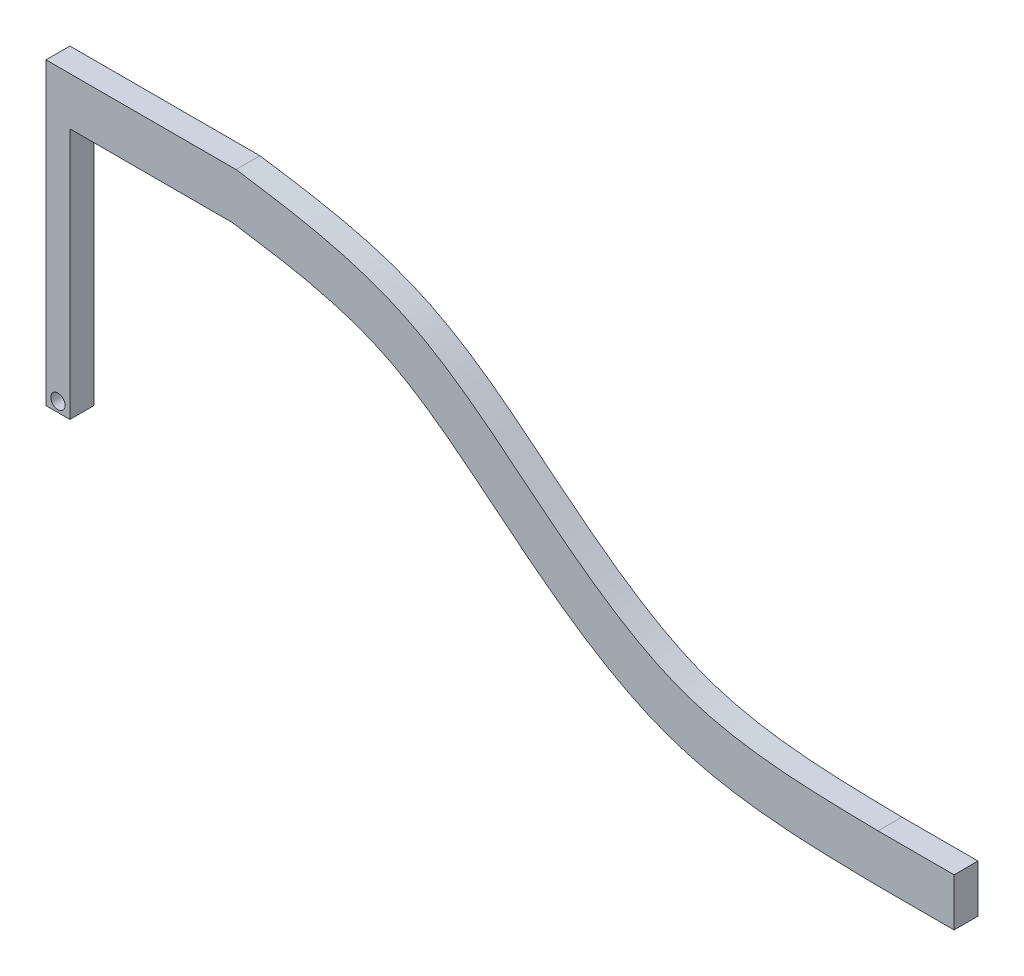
ISO-10303-21;
HEADER;
FILE_DESCRIPTION(('STEP AP214'),'2;1');
FILE_NAME('part.step','',(''),(''),'','','');
FILE_SCHEMA(('AUTOMOTIVE_DESIGN { 1 0 10303 214 1 1 1 1 }'));
ENDSEC;
DATA;
#1=APPLICATION_CONTEXT('core data for automotive mechanical design processes');
#2=APPLICATION_PROTOCOL_DEFINITION('international standard','automotive_design',2000,#1);
#3=PRODUCT_CONTEXT('',#1,'mechanical');
#4=PRODUCT('Part','Part','',(#3));
#5=PRODUCT_RELATED_PRODUCT_CATEGORY('part','',(#4));
#6=PRODUCT_DEFINITION_FORMATION('','',#4);
#7=PRODUCT_DEFINITION_CONTEXT('part definition',#1,'design');
#8=PRODUCT_DEFINITION('design','',#6,#7);
#9=PRODUCT_DEFINITION_SHAPE('','',#8);
#10=(LENGTH_UNIT() NAMED_UNIT(*) SI_UNIT(.MILLI.,.METRE.));
#11=(NAMED_UNIT(*) PLANE_ANGLE_UNIT() SI_UNIT($,.RADIAN.));
#12=(NAMED_UNIT(*) SI_UNIT($,.STERADIAN.) SOLID_ANGLE_UNIT());
#13=UNCERTAINTY_MEASURE_WITH_UNIT(LENGTH_MEASURE(1.E-05),#10,'distance_accuracy_value','');
#14=(GEOMETRIC_REPRESENTATION_CONTEXT(3) GLOBAL_UNCERTAINTY_ASSIGNED_CONTEXT((#13)) GLOBAL_UNIT_ASSIGNED_CONTEXT((#10,
#11,#12)) REPRESENTATION_CONTEXT('',''));
#15=CARTESIAN_POINT('',(0.,0.,0.));
#16=DIRECTION('',(0.,0.,1.));
#17=DIRECTION('',(1.,0.,0.));
#18=AXIS2_PLACEMENT_3D('',#15,#16,#17);
#19=CARTESIAN_POINT('',(0.,15.922114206,1.27));
#20=DIRECTION('',(0.,1.,0.));
#21=DIRECTION('',(0.,0.,1.));
#22=AXIS2_PLACEMENT_3D('',#19,#20,#21);
#23=PLANE('',#22);
#24=DIRECTION('',(1.,0.,0.));
#25=VECTOR('',#24,1.);
#26=CARTESIAN_POINT('',(0.,15.922114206,0.));
#27=LINE('',#26,#25);
#28=CARTESIAN_POINT('',(-1.27,15.922114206,0.));
#29=VERTEX_POINT('',#28);
#30=CARTESIAN_POINT('',(8.83455771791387,15.922114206,0.));
#31=VERTEX_POINT('',#30);
#32=EDGE_CURVE('E198',#29,#31,#27,.T.);
#33=ORIENTED_EDGE('',*,*,#32,.F.);
#34=DIRECTION('',(0.,0.,-1.));
#35=VECTOR('',#34,1.);
#36=CARTESIAN_POINT('',(-1.27,15.922114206,67.9279261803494));
#37=LINE('',#36,#35);
#38=CARTESIAN_POINT('',(-1.27,15.922114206,1.26999999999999));
#39=VERTEX_POINT('',#38);
#40=EDGE_CURVE('E46',#39,#29,#37,.T.);
#41=ORIENTED_EDGE('',*,*,#40,.F.);
#42=DIRECTION('',(1.,0.,0.));
#43=VECTOR('',#42,1.);
#44=CARTESIAN_POINT('',(0.,15.922114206,1.27));
#45=LINE('',#44,#43);
#46=CARTESIAN_POINT('',(8.83455771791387,15.922114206,1.27));
#47=VERTEX_POINT('',#46);
#48=EDGE_CURVE('E178',#39,#47,#45,.T.);
#49=ORIENTED_EDGE('',*,*,#48,.T.);
#50=DIRECTION('',(0.,0.,-1.));
#51=VECTOR('',#50,1.);
#52=CARTESIAN_POINT('',(8.83455771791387,15.922114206,1.27));
#53=LINE('',#52,#51);
#54=EDGE_CURVE('E206',#47,#31,#53,.T.);
#55=ORIENTED_EDGE('',*,*,#54,.T.);
#56=EDGE_LOOP('',(#33,#41,#49,#55));
#57=FACE_BOUND('',#56,.T.);
#58=ADVANCED_FACE('F31',(#57),#23,.T.);
#59=CARTESIAN_POINT('',(0.,0.,1.27));
#60=DIRECTION('',(0.,-1.,0.));
#61=DIRECTION('',(0.,0.,-1.));
#62=AXIS2_PLACEMENT_3D('',#59,#60,#61);
#63=PLANE('',#62);
#64=DIRECTION('',(-1.,0.,0.));
#65=VECTOR('',#64,1.);
#66=CARTESIAN_POINT('',(0.,0.,1.27));
#67=LINE('',#66,#65);
#68=CARTESIAN_POINT('',(0.,0.,1.27));
#69=VERTEX_POINT('',#68);
#70=CARTESIAN_POINT('',(-1.27,0.,1.26999999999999));
#71=VERTEX_POINT('',#70);
#72=EDGE_CURVE('E119',#69,#71,#67,.T.);
#73=ORIENTED_EDGE('',*,*,#72,.T.);
#74=DIRECTION('',(0.,0.,-1.));
#75=VECTOR('',#74,1.);
#76=CARTESIAN_POINT('',(-1.27,0.,67.9279261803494));
#77=LINE('',#76,#75);
#78=CARTESIAN_POINT('',(-1.27,0.,0.));
#79=VERTEX_POINT('',#78);
#80=EDGE_CURVE('E189',#71,#79,#77,.T.);
#81=ORIENTED_EDGE('',*,*,#80,.T.);
#82=DIRECTION('',(-1.,0.,0.));
#83=VECTOR('',#82,1.);
#84=CARTESIAN_POINT('',(0.,0.,0.));
#85=LINE('',#84,#83);
#86=CARTESIAN_POINT('',(0.,0.,0.));
#87=VERTEX_POINT('',#86);
#88=EDGE_CURVE('E236',#87,#79,#85,.T.);
#89=ORIENTED_EDGE('',*,*,#88,.F.);
#90=DIRECTION('',(0.,0.,-1.));
#91=VECTOR('',#90,1.);
#92=CARTESIAN_POINT('',(0.,0.,1.27));
#93=LINE('',#92,#91);
#94=EDGE_CURVE('E129',#69,#87,#93,.T.);
#95=ORIENTED_EDGE('',*,*,#94,.F.);
#96=EDGE_LOOP('',(#73,#81,#89,#95));
#97=FACE_BOUND('',#96,.T.);
#98=ADVANCED_FACE('F159',(#97),#63,.T.);
#99=CARTESIAN_POINT('',(26.7020393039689,7.21110102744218,1.27));
#100=DIRECTION('',(0.,0.,-1.));
#101=DIRECTION('',(-1.,0.,0.));
#102=AXIS2_PLACEMENT_3D('',#99,#100,#101);
#103=PLANE('',#102);
#104=CARTESIAN_POINT('',(-0.635,0.517047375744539,1.27));
#105=DIRECTION('',(0.,0.,1.));
#106=DIRECTION('',(1.,0.,0.));
#107=AXIS2_PLACEMENT_3D('',#104,#105,#106);
#108=CIRCLE('',#107,0.381);
#109=CARTESIAN_POINT('',(-0.254,0.517047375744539,1.27));
#110=VERTEX_POINT('',#109);
#111=EDGE_CURVE('E252',#110,#110,#108,.T.);
#112=ORIENTED_EDGE('',*,*,#111,.F.);
#113=EDGE_LOOP('',(#112));
#114=FACE_BOUND('',#113,.T.);
#115=DIRECTION('',(0.,1.,0.));
#116=VECTOR('',#115,1.);
#117=CARTESIAN_POINT('',(-1.27,7.21110102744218,1.27));
#118=LINE('',#117,#116);
#119=EDGE_CURVE('E192',#71,#39,#118,.T.);
#120=ORIENTED_EDGE('',*,*,#119,.F.);
#121=ORIENTED_EDGE('',*,*,#72,.F.);
#122=DIRECTION('',(0.,1.,0.));
#123=VECTOR('',#122,1.);
#124=CARTESIAN_POINT('',(0.,0.,1.27));
#125=LINE('',#124,#123);
#126=CARTESIAN_POINT('',(0.,13.382114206,1.27));
#127=VERTEX_POINT('',#126);
#128=EDGE_CURVE('E111',#69,#127,#125,.T.);
#129=ORIENTED_EDGE('',*,*,#128,.T.);
#130=DIRECTION('',(1.,0.,0.));
#131=VECTOR('',#130,1.);
#132=CARTESIAN_POINT('',(0.,13.382114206,1.27));
#133=LINE('',#132,#131);
#134=CARTESIAN_POINT('',(8.64245458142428,13.382114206,1.27));
#135=VERTEX_POINT('',#134);
#136=EDGE_CURVE('E116',#127,#135,#133,.T.);
#137=ORIENTED_EDGE('',*,*,#136,.T.);
#138=CARTESIAN_POINT('',(8.64245458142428,13.382114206,1.27));
#139=CARTESIAN_POINT('',(11.3837031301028,12.9650811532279,1.27));
#140=CARTESIAN_POINT('',(16.6168440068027,12.1689502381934,1.27));
#141=CARTESIAN_POINT('',(23.466093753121,6.44904374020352,1.27));
#142=CARTESIAN_POINT('',(31.478990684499,0.189830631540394,1.27));
#143=CARTESIAN_POINT('',(39.0643321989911,0.0642075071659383,1.27));
#144=CARTESIAN_POINT('',(42.9412925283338,0.,1.27));
#145=B_SPLINE_CURVE_WITH_KNOTS('',3,(#138,#139,#140,#141,#142,#143,#144),.UNSPECIFIED.,.F.,.F.,
(4,1,1,1,4),(0.,0.216097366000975,0.412537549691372,0.699740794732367,1.),.UNSPECIFIED.);
#146=CARTESIAN_POINT('',(42.9412925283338,0.,1.27));
#147=VERTEX_POINT('',#146);
#148=EDGE_CURVE('E54',#135,#147,#145,.T.);
#149=ORIENTED_EDGE('',*,*,#148,.T.);
#150=DIRECTION('',(1.,0.,0.));
#151=VECTOR('',#150,1.);
#152=CARTESIAN_POINT('',(42.9412925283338,0.,1.27));
#153=LINE('',#152,#151);
#154=CARTESIAN_POINT('',(47.0052925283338,0.,1.27));
#155=VERTEX_POINT('',#154);
#156=EDGE_CURVE('E93',#147,#155,#153,.T.);
#157=ORIENTED_EDGE('',*,*,#156,.T.);
#158=DIRECTION('',(0.,-1.,0.));
#159=VECTOR('',#158,1.);
#160=CARTESIAN_POINT('',(47.0052925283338,2.54,1.27));
#161=LINE('',#160,#159);
#162=CARTESIAN_POINT('',(47.0052925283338,2.54,1.27));
#163=VERTEX_POINT('',#162);
#164=EDGE_CURVE('E222',#163,#155,#161,.T.);
#165=ORIENTED_EDGE('',*,*,#164,.F.);
#166=DIRECTION('',(1.,0.,0.));
#167=VECTOR('',#166,1.);
#168=CARTESIAN_POINT('',(42.9412925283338,2.54,1.27));
#169=LINE('',#168,#167);
#170=CARTESIAN_POINT('',(42.9623243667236,2.54,1.27));
#171=VERTEX_POINT('',#170);
#172=EDGE_CURVE('E179',#171,#163,#169,.T.);
#173=ORIENTED_EDGE('',*,*,#172,.F.);
#174=CARTESIAN_POINT('',(8.83455771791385,15.922114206,1.27));
#175=CARTESIAN_POINT('',(9.23273478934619,15.8615385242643,1.27));
#176=CARTESIAN_POINT('',(9.63311586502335,15.8009005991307,1.27));
#177=CARTESIAN_POINT('',(10.4441054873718,15.6741757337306,1.27));
#178=CARTESIAN_POINT('',(10.8535402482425,15.6082191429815,1.27));
#179=CARTESIAN_POINT('',(12.0908968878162,15.3953394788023,1.27));
#180=CARTESIAN_POINT('',(12.9279317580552,15.2336201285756,1.27));
#181=CARTESIAN_POINT('',(14.6114985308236,14.8272292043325,1.27));
#182=CARTESIAN_POINT('',(15.4583285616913,14.5824900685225,1.27));
#183=CARTESIAN_POINT('',(16.7207698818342,14.115925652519,1.27));
#184=CARTESIAN_POINT('',(17.1402076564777,13.9437798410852,1.27));
#185=CARTESIAN_POINT('',(17.9724186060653,13.5599427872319,1.27));
#186=CARTESIAN_POINT('',(18.3764903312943,13.3519568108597,1.27));
#187=CARTESIAN_POINT('',(19.5491715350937,12.6952136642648,1.27));
#188=CARTESIAN_POINT('',(20.2815702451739,12.2126050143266,1.27));
#189=CARTESIAN_POINT('',(21.677061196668,11.2109690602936,1.27));
#190=CARTESIAN_POINT('',(22.3404330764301,10.6917151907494,1.27));
#191=CARTESIAN_POINT('',(23.6255901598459,9.65963581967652,1.27));
#192=CARTESIAN_POINT('',(24.2449733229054,9.14974524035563,1.27));
#193=CARTESIAN_POINT('',(25.4784794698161,8.1566812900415,1.27));
#194=CARTESIAN_POINT('',(26.0912160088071,7.67245835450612,1.27));
#195=CARTESIAN_POINT('',(27.9236858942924,6.28838637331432,1.27));
#196=CARTESIAN_POINT('',(29.1380165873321,5.45869430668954,1.27));
#197=CARTESIAN_POINT('',(30.9601431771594,4.46366236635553,1.27));
#198=CARTESIAN_POINT('',(31.5674093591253,4.17321837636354,1.27));
#199=CARTESIAN_POINT('',(32.481150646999,3.8087078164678,1.27));
#200=CARTESIAN_POINT('',(32.7851437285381,3.69964034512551,1.27));
#201=CARTESIAN_POINT('',(33.4102256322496,3.49948761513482,1.27));
#202=CARTESIAN_POINT('',(33.7295545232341,3.40886505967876,1.27));
#203=CARTESIAN_POINT('',(35.3598925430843,2.99892132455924,1.27));
#204=CARTESIAN_POINT('',(36.7742000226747,2.81059923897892,1.27));
#205=CARTESIAN_POINT('',(39.7660493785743,2.59467989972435,1.27));
#206=CARTESIAN_POINT('',(41.3415368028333,2.56684399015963,1.27));
#207=CARTESIAN_POINT('',(42.9623243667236,2.54,1.27));
#208=B_SPLINE_CURVE_WITH_KNOTS('',3,(#174,#175,#176,#177,#178,#179,#180,#181,#182,#183,#184,
#185,#186,#187,#188,#189,#190,#191,#192,#193,#194,#195,#196,#197,#198,#199,#200,#201,#202,#203,
#204,#205,#206,#207),.UNSPECIFIED.,.F.,.F.,(4,2,2,2,2,2,2,2,2,2,2,2,2,2,2,2,4),(0.,
0.0312499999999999,0.0624999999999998,0.125,0.1875,0.21875,0.25,0.3125,0.375,0.4375,0.5,0.625,
0.6875,0.71875,0.750000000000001,0.875,1.),.UNSPECIFIED.);
#209=EDGE_CURVE('E171',#47,#171,#208,.T.);
#210=ORIENTED_EDGE('',*,*,#209,.F.);
#211=ORIENTED_EDGE('',*,*,#48,.F.);
#212=EDGE_LOOP('',(#120,#121,#129,#137,#149,#157,#165,#173,#210,#211));
#213=FACE_BOUND('',#212,.T.);
#214=ADVANCED_FACE('F114',(#114,#213),#103,.F.);
#215=CARTESIAN_POINT('',(26.7020393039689,7.21110102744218,0.));
#216=DIRECTION('',(0.,0.,-1.));
#217=DIRECTION('',(-1.,0.,0.));
#218=AXIS2_PLACEMENT_3D('',#215,#216,#217);
#219=PLANE('',#218);
#220=CARTESIAN_POINT('',(-0.635,0.517047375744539,0.));
#221=DIRECTION('',(0.,0.,1.));
#222=DIRECTION('',(1.,0.,0.));
#223=AXIS2_PLACEMENT_3D('',#220,#221,#222);
#224=CIRCLE('',#223,0.381);
#225=CARTESIAN_POINT('',(-0.254,0.517047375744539,0.));
#226=VERTEX_POINT('',#225);
#227=EDGE_CURVE('E250',#226,#226,#224,.T.);
#228=ORIENTED_EDGE('',*,*,#227,.T.);
#229=EDGE_LOOP('',(#228));
#230=FACE_BOUND('',#229,.T.);
#231=ORIENTED_EDGE('',*,*,#88,.T.);
#232=DIRECTION('',(0.,1.,0.));
#233=VECTOR('',#232,1.);
#234=CARTESIAN_POINT('',(-1.27,7.21110102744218,0.));
#235=LINE('',#234,#233);
#236=EDGE_CURVE('E11',#79,#29,#235,.T.);
#237=ORIENTED_EDGE('',*,*,#236,.T.);
#238=ORIENTED_EDGE('',*,*,#32,.T.);
#239=CARTESIAN_POINT('',(8.83455771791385,15.922114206,0.));
#240=CARTESIAN_POINT('',(9.23273478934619,15.8615385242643,0.));
#241=CARTESIAN_POINT('',(9.63311586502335,15.8009005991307,0.));
#242=CARTESIAN_POINT('',(10.4441054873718,15.6741757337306,0.));
#243=CARTESIAN_POINT('',(10.8535402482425,15.6082191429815,0.));
#244=CARTESIAN_POINT('',(12.0908968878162,15.3953394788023,0.));
#245=CARTESIAN_POINT('',(12.9279317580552,15.2336201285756,0.));
#246=CARTESIAN_POINT('',(14.6114985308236,14.8272292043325,0.));
#247=CARTESIAN_POINT('',(15.4583285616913,14.5824900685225,0.));
#248=CARTESIAN_POINT('',(16.7207698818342,14.115925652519,0.));
#249=CARTESIAN_POINT('',(17.1402076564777,13.9437798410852,0.));
#250=CARTESIAN_POINT('',(17.9724186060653,13.5599427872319,0.));
#251=CARTESIAN_POINT('',(18.3764903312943,13.3519568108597,0.));
#252=CARTESIAN_POINT('',(19.5491715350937,12.6952136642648,0.));
#253=CARTESIAN_POINT('',(20.2815702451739,12.2126050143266,0.));
#254=CARTESIAN_POINT('',(21.677061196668,11.2109690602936,0.));
#255=CARTESIAN_POINT('',(22.3404330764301,10.6917151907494,0.));
#256=CARTESIAN_POINT('',(23.6255901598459,9.65963581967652,0.));
#257=CARTESIAN_POINT('',(24.2449733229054,9.14974524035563,0.));
#258=CARTESIAN_POINT('',(25.4784794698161,8.1566812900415,0.));
#259=CARTESIAN_POINT('',(26.0912160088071,7.67245835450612,0.));
#260=CARTESIAN_POINT('',(27.9236858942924,6.28838637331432,0.));
#261=CARTESIAN_POINT('',(29.1380165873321,5.45869430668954,0.));
#262=CARTESIAN_POINT('',(30.9601431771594,4.46366236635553,0.));
#263=CARTESIAN_POINT('',(31.5674093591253,4.17321837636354,0.));
#264=CARTESIAN_POINT('',(32.481150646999,3.8087078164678,0.));
#265=CARTESIAN_POINT('',(32.7851437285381,3.69964034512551,0.));
#266=CARTESIAN_POINT('',(33.4102256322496,3.49948761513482,0.));
#267=CARTESIAN_POINT('',(33.7295545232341,3.40886505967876,0.));
#268=CARTESIAN_POINT('',(35.3598925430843,2.99892132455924,0.));
#269=CARTESIAN_POINT('',(36.7742000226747,2.81059923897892,0.));
#270=CARTESIAN_POINT('',(39.7660493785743,2.59467989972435,0.));
#271=CARTESIAN_POINT('',(41.3415368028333,2.56684399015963,0.));
#272=CARTESIAN_POINT('',(42.9623243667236,2.54,0.));
#273=B_SPLINE_CURVE_WITH_KNOTS('',3,(#239,#240,#241,#242,#243,#244,#245,#246,#247,#248,#249,
#250,#251,#252,#253,#254,#255,#256,#257,#258,#259,#260,#261,#262,#263,#264,#265,#266,#267,#268,
#269,#270,#271,#272),.UNSPECIFIED.,.F.,.F.,(4,2,2,2,2,2,2,2,2,2,2,2,2,2,2,2,4),(0.,
0.0312499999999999,0.0624999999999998,0.125,0.1875,0.21875,0.25,0.3125,0.375,0.4375,0.5,0.625,
0.6875,0.71875,0.750000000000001,0.875,1.),.UNSPECIFIED.);
#274=CARTESIAN_POINT('',(42.9623243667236,2.54,0.));
#275=VERTEX_POINT('',#274);
#276=EDGE_CURVE('E208',#31,#275,#273,.T.);
#277=ORIENTED_EDGE('',*,*,#276,.T.);
#278=DIRECTION('',(1.,0.,0.));
#279=VECTOR('',#278,1.);
#280=CARTESIAN_POINT('',(42.9412925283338,2.54,0.));
#281=LINE('',#280,#279);
#282=CARTESIAN_POINT('',(47.0052925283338,2.54,0.));
#283=VERTEX_POINT('',#282);
#284=EDGE_CURVE('E226',#275,#283,#281,.T.);
#285=ORIENTED_EDGE('',*,*,#284,.T.);
#286=DIRECTION('',(0.,-1.,0.));
#287=VECTOR('',#286,1.);
#288=CARTESIAN_POINT('',(47.0052925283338,2.54,0.));
#289=LINE('',#288,#287);
#290=CARTESIAN_POINT('',(47.0052925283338,0.,0.));
#291=VERTEX_POINT('',#290);
#292=EDGE_CURVE('E220',#283,#291,#289,.T.);
#293=ORIENTED_EDGE('',*,*,#292,.T.);
#294=DIRECTION('',(1.,0.,0.));
#295=VECTOR('',#294,1.);
#296=CARTESIAN_POINT('',(42.9412925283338,0.,0.));
#297=LINE('',#296,#295);
#298=CARTESIAN_POINT('',(42.9412925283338,0.,0.));
#299=VERTEX_POINT('',#298);
#300=EDGE_CURVE('E141',#299,#291,#297,.T.);
#301=ORIENTED_EDGE('',*,*,#300,.F.);
#302=CARTESIAN_POINT('',(8.64245458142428,13.382114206,0.));
#303=CARTESIAN_POINT('',(11.3837031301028,12.9650811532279,0.));
#304=CARTESIAN_POINT('',(16.6168440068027,12.1689502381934,0.));
#305=CARTESIAN_POINT('',(23.466093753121,6.44904374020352,0.));
#306=CARTESIAN_POINT('',(31.478990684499,0.189830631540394,0.));
#307=CARTESIAN_POINT('',(39.0643321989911,0.0642075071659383,0.));
#308=CARTESIAN_POINT('',(42.9412925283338,0.,0.));
#309=B_SPLINE_CURVE_WITH_KNOTS('',3,(#302,#303,#304,#305,#306,#307,#308),.UNSPECIFIED.,.F.,.F.,
(4,1,1,1,4),(0.,0.216097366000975,0.412537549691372,0.699740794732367,1.),.UNSPECIFIED.);
#310=CARTESIAN_POINT('',(8.64245458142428,13.382114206,0.));
#311=VERTEX_POINT('',#310);
#312=EDGE_CURVE('E87',#311,#299,#309,.T.);
#313=ORIENTED_EDGE('',*,*,#312,.F.);
#314=DIRECTION('',(1.,0.,0.));
#315=VECTOR('',#314,1.);
#316=CARTESIAN_POINT('',(0.,13.382114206,0.));
#317=LINE('',#316,#315);
#318=CARTESIAN_POINT('',(0.,13.382114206,0.));
#319=VERTEX_POINT('',#318);
#320=EDGE_CURVE('E239',#319,#311,#317,.T.);
#321=ORIENTED_EDGE('',*,*,#320,.F.);
#322=DIRECTION('',(0.,1.,0.));
#323=VECTOR('',#322,1.);
#324=CARTESIAN_POINT('',(0.,0.,0.));
#325=LINE('',#324,#323);
#326=EDGE_CURVE('E126',#87,#319,#325,.T.);
#327=ORIENTED_EDGE('',*,*,#326,.F.);
#328=EDGE_LOOP('',(#231,#237,#238,#277,#285,#293,#301,#313,#321,#327));
#329=FACE_BOUND('',#328,.T.);
#330=ADVANCED_FACE('F152',(#230,#329),#219,.T.);
#331=CARTESIAN_POINT('',(42.9412925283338,0.,1.27));
#332=DIRECTION('',(0.,1.,0.));
#333=DIRECTION('',(0.,0.,1.));
#334=AXIS2_PLACEMENT_3D('',#331,#332,#333);
#335=PLANE('',#334);
#336=ORIENTED_EDGE('',*,*,#300,.T.);
#337=DIRECTION('',(0.,0.,-1.));
#338=VECTOR('',#337,1.);
#339=CARTESIAN_POINT('',(47.0052925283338,0.,1.27));
#340=LINE('',#339,#338);
#341=EDGE_CURVE('E39',#155,#291,#340,.T.);
#342=ORIENTED_EDGE('',*,*,#341,.F.);
#343=ORIENTED_EDGE('',*,*,#156,.F.);
#344=DIRECTION('',(0.,0.,-1.));
#345=VECTOR('',#344,1.);
#346=CARTESIAN_POINT('',(42.9412925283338,0.,1.27));
#347=LINE('',#346,#345);
#348=EDGE_CURVE('E134',#147,#299,#347,.T.);
#349=ORIENTED_EDGE('',*,*,#348,.T.);
#350=EDGE_LOOP('',(#336,#342,#343,#349));
#351=FACE_BOUND('',#350,.T.);
#352=ADVANCED_FACE('F33',(#351),#335,.F.);
#353=CARTESIAN_POINT('',(47.0052925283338,2.54,1.27));
#354=DIRECTION('',(1.,0.,0.));
#355=DIRECTION('',(0.,0.,-1.));
#356=AXIS2_PLACEMENT_3D('',#353,#354,#355);
#357=PLANE('',#356);
#358=ORIENTED_EDGE('',*,*,#292,.F.);
#359=DIRECTION('',(0.,0.,-1.));
#360=VECTOR('',#359,1.);
#361=CARTESIAN_POINT('',(47.0052925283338,2.54,1.27));
#362=LINE('',#361,#360);
#363=EDGE_CURVE('E210',#163,#283,#362,.T.);
#364=ORIENTED_EDGE('',*,*,#363,.F.);
#365=ORIENTED_EDGE('',*,*,#164,.T.);
#366=ORIENTED_EDGE('',*,*,#341,.T.);
#367=EDGE_LOOP('',(#358,#364,#365,#366));
#368=FACE_BOUND('',#367,.T.);
#369=ADVANCED_FACE('F218',(#368),#357,.T.);
#370=CARTESIAN_POINT('',(42.9412925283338,2.54,1.27));
#371=DIRECTION('',(0.,1.,0.));
#372=DIRECTION('',(0.,0.,1.));
#373=AXIS2_PLACEMENT_3D('',#370,#371,#372);
#374=PLANE('',#373);
#375=ORIENTED_EDGE('',*,*,#284,.F.);
#376=DIRECTION('',(0.,0.,-1.));
#377=VECTOR('',#376,1.);
#378=CARTESIAN_POINT('',(42.9623243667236,2.54,1.27));
#379=LINE('',#378,#377);
#380=EDGE_CURVE('E204',#171,#275,#379,.T.);
#381=ORIENTED_EDGE('',*,*,#380,.F.);
#382=ORIENTED_EDGE('',*,*,#172,.T.);
#383=ORIENTED_EDGE('',*,*,#363,.T.);
#384=EDGE_LOOP('',(#375,#381,#382,#383));
#385=FACE_BOUND('',#384,.T.);
#386=ADVANCED_FACE('F169',(#385),#374,.T.);
#387=DIRECTION('',(0.,0.,-1.));
#388=VECTOR('',#387,1.);
#389=SURFACE_OF_LINEAR_EXTRUSION('',#208,#388);
#390=ORIENTED_EDGE('',*,*,#276,.F.);
#391=ORIENTED_EDGE('',*,*,#54,.F.);
#392=ORIENTED_EDGE('',*,*,#209,.T.);
#393=ORIENTED_EDGE('',*,*,#380,.T.);
#394=EDGE_LOOP('',(#390,#391,#392,#393));
#395=FACE_BOUND('',#394,.T.);
#396=ADVANCED_FACE('F158',(#395),#389,.T.);
#397=CARTESIAN_POINT('',(0.,0.,1.27));
#398=DIRECTION('',(-1.,0.,0.));
#399=DIRECTION('',(0.,0.,1.));
#400=AXIS2_PLACEMENT_3D('',#397,#398,#399);
#401=PLANE('',#400);
#402=ORIENTED_EDGE('',*,*,#326,.T.);
#403=DIRECTION('',(0.,0.,-1.));
#404=VECTOR('',#403,1.);
#405=CARTESIAN_POINT('',(0.,13.382114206,1.27));
#406=LINE('',#405,#404);
#407=EDGE_CURVE('E123',#127,#319,#406,.T.);
#408=ORIENTED_EDGE('',*,*,#407,.F.);
#409=ORIENTED_EDGE('',*,*,#128,.F.);
#410=ORIENTED_EDGE('',*,*,#94,.T.);
#411=EDGE_LOOP('',(#402,#408,#409,#410));
#412=FACE_BOUND('',#411,.T.);
#413=ADVANCED_FACE('F124',(#412),#401,.F.);
#414=CARTESIAN_POINT('',(0.,13.382114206,1.27));
#415=DIRECTION('',(0.,1.,0.));
#416=DIRECTION('',(0.,0.,1.));
#417=AXIS2_PLACEMENT_3D('',#414,#415,#416);
#418=PLANE('',#417);
#419=ORIENTED_EDGE('',*,*,#320,.T.);
#420=DIRECTION('',(0.,0.,-1.));
#421=VECTOR('',#420,1.);
#422=CARTESIAN_POINT('',(8.64245458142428,13.382114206,1.27));
#423=LINE('',#422,#421);
#424=EDGE_CURVE('E130',#135,#311,#423,.T.);
#425=ORIENTED_EDGE('',*,*,#424,.F.);
#426=ORIENTED_EDGE('',*,*,#136,.F.);
#427=ORIENTED_EDGE('',*,*,#407,.T.);
#428=EDGE_LOOP('',(#419,#425,#426,#427));
#429=FACE_BOUND('',#428,.T.);
#430=ADVANCED_FACE('F132',(#429),#418,.F.);
#431=DIRECTION('',(0.,0.,-1.));
#432=VECTOR('',#431,1.);
#433=SURFACE_OF_LINEAR_EXTRUSION('',#145,#432);
#434=ORIENTED_EDGE('',*,*,#312,.T.);
#435=ORIENTED_EDGE('',*,*,#348,.F.);
#436=ORIENTED_EDGE('',*,*,#148,.F.);
#437=ORIENTED_EDGE('',*,*,#424,.T.);
#438=EDGE_LOOP('',(#434,#435,#436,#437));
#439=FACE_BOUND('',#438,.T.);
#440=ADVANCED_FACE('F147',(#439),#433,.F.);
#441=CARTESIAN_POINT('',(-1.27,0.,67.9279261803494));
#442=DIRECTION('',(-1.,0.,0.));
#443=DIRECTION('',(0.,0.,1.));
#444=AXIS2_PLACEMENT_3D('',#441,#442,#443);
#445=PLANE('',#444);
#446=ORIENTED_EDGE('',*,*,#80,.F.);
#447=ORIENTED_EDGE('',*,*,#119,.T.);
#448=ORIENTED_EDGE('',*,*,#40,.T.);
#449=ORIENTED_EDGE('',*,*,#236,.F.);
#450=EDGE_LOOP('',(#446,#447,#448,#449));
#451=FACE_BOUND('',#450,.T.);
#452=ADVANCED_FACE('F151',(#451),#445,.T.);
#453=CARTESIAN_POINT('',(-0.635,0.517047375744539,0.));
#454=DIRECTION('',(0.,0.,1.));
#455=DIRECTION('',(1.,0.,0.));
#456=AXIS2_PLACEMENT_3D('',#453,#454,#455);
#457=CYLINDRICAL_SURFACE('',#456,0.381);
#458=ORIENTED_EDGE('',*,*,#227,.F.);
#459=EDGE_LOOP('',(#458));
#460=FACE_BOUND('',#459,.T.);
#461=ORIENTED_EDGE('',*,*,#111,.T.);
#462=EDGE_LOOP('',(#461));
#463=FACE_BOUND('',#462,.T.);
#464=ADVANCED_FACE('F259',(#460,#463),#457,.F.);
#465=CLOSED_SHELL('',(#58,#98,#214,#330,#352,#369,#386,#396,#413,#430,#440,#452,#464));
#466=MANIFOLD_SOLID_BREP('B2',#465);
#467=ADVANCED_BREP_SHAPE_REPRESENTATION('',(#18,#466),#14);
#468=SHAPE_DEFINITION_REPRESENTATION(#9,#467);
ENDSEC;
END-ISO-10303-21;
